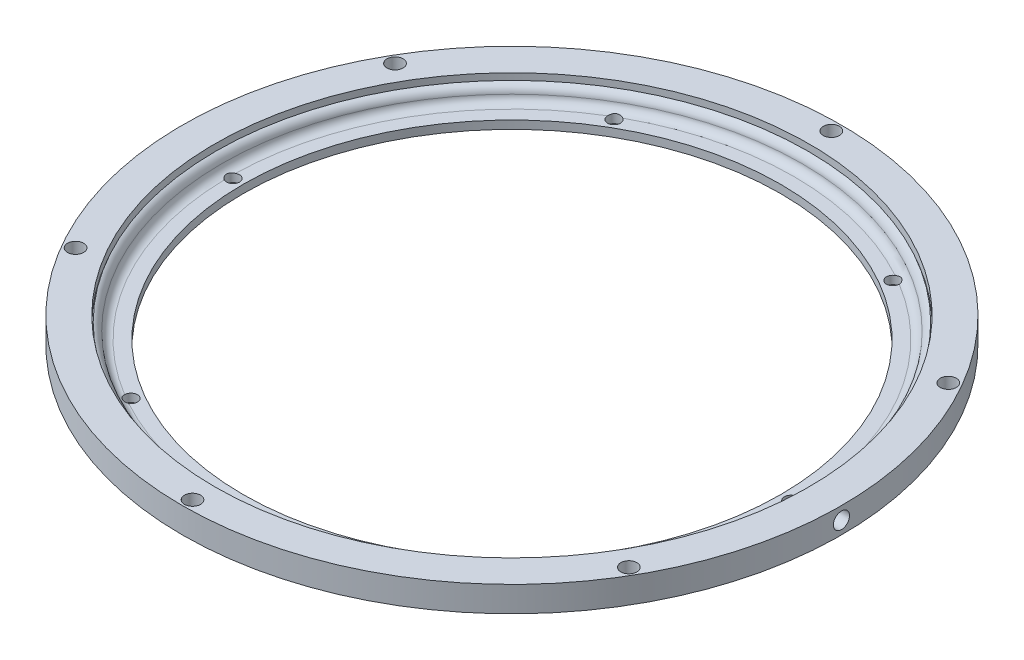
from build123d import *

# Parameters (mm, degrees)
CUT_EXTRUDE1_REACH            = 232.253
CUT_EXTRUDE1_END_MAJOR_RADIUS = 139.0875
CUT_EXTRUDE1_END_MINOR_RADIUS = 7.769966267
CIRPATTERN1_COUNT             = 6
CUT_EXTRUDE2_DEPTH            = 10
CIRPATTERN2_COUNT             = 6
SKETCH5_R                     = 3.175
CUT_EXTRUDE3_DEPTH            = 231.039850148
CIRPATTERN3_COUNT             = 6
SKETCH8_W                     = 9
SKETCH8_H                     = 10
REVOLVE3_ANGLE                = 5
SKETCH7_W                     = 14.5
SKETCH7_H                     = 3.96875
SKETCH9_R                     = 3.96875
CUT_EXTRUDE4_DEPTH            = 231.253409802
CIRPATTERN4_COUNT             = 6


with BuildPart() as part:
    # Sketch1 → Revolve2 (revolve)
    with BuildSketch(Plane.XY, mode=Mode.PRIVATE) as revolve2_sk:
        with BuildLine():
            Line((162.5, 14.2875), (162.5, 1.733499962))
            Line((162.5, 1.733499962), (149.5, 1.733499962))
            Line((149.5, 1.733499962), (149.5, 4.768474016))
            ThreePointArc((149.5, 4.768474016), (150.206637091, 8.669318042), (146.5, 10.075291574))
            Line((146.5, 10.075291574), (146.5, 14.2875))
            Line((146.5, 14.2875), (162.5, 14.2875))
        make_face()
        with BuildLine():
            Line((132.516, 0), (148, 0))
            Line((148, 0), (148, 4.083041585))
            ThreePointArc((148, 4.083041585), (144.579009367, 6.128361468), (146, 9.852243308))
            Line((146, 9.852243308), (146, 11.383553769))
            ThreePointArc((146, 11.383553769), (143.960917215, 9.912902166), (143.028992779, 7.57790932))
            ThreePointArc((143.028992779, 7.57790932), (141.749116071, 5.027879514), (139.0875, 4))
            Line((139.0875, 4), (132.516, 4))
            Line((132.516, 4), (132.516, 0))
        make_face()
    revolve(revolve2_sk.sketch.rotate(Axis((0, 8.550989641, 0), (0, -1, 0)), 90), axis=Axis((0, 8.550989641, 0), (0, -1, 0)))

    # Cut-Extrude1: up to this torus (the profile starts outside it)
    cut_extrude1_end = Plane(origin=(0, 7.959966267, 0), z_dir=(0, 1, 0)) * Torus(CUT_EXTRUDE1_END_MAJOR_RADIUS, CUT_EXTRUDE1_END_MINOR_RADIUS, mode=Mode.PRIVATE)
    # Sketch2 → Cut-Extrude1 (cut, up to the surface)
    with BuildSketch(Plane.XZ, mode=Mode.PRIVATE) as cut_extrude1_sk1:
        with BuildLine():
            ThreePointArc((75.01090718, -111.6598319), (116.494273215, -67.258), (134.205704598, -9.131435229))
            ThreePointArc((134.205704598, -9.131435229), (137.385386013, -6.356883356), (140.159937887, -9.536564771))
            ThreePointArc((140.159937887, -9.536564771), (121.662712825, -70.242), (78.3388763, -116.613784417))
            ThreePointArc((78.3388763, -116.613784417), (74.197915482, -115.800792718), (75.01090718, -111.6598319))
        make_face()
    cut_extrude1_tool1 = extrude(cut_extrude1_sk1.sketch, amount=-CUT_EXTRUDE1_REACH, mode=Mode.PRIVATE) - cut_extrude1_end
    cut_extrude1 = cut_extrude1_tool1.solids().sort_by_distance((120.543923, 0, -69.596066))[0]
    add(cut_extrude1, mode=Mode.SUBTRACT)

    # CirPattern1: Cut-Extrude1 ×6 about axis
    cirpattern1_axis = Axis((0, 0, 0), (0, 1, 0))
    for i in range(1, CIRPATTERN1_COUNT):
        add(cut_extrude1.rotate(cirpattern1_axis, i * 360 / CIRPATTERN1_COUNT), mode=Mode.SUBTRACT)

    # Sketch3 → Cut-Extrude2 (cut)
    with BuildSketch(Plane.XZ.offset(-1.733499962)):
        with BuildLine():
            Line((142.795745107, 73.277726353), (134.991399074, 68.77188507))
            ThreePointArc((134.991399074, 68.77188507), (151.5, 0), (134.991399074, -68.77188507))
            Line((134.991399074, -68.77188507), (142.795745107, -73.277726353))
            ThreePointArc((142.795745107, -73.277726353), (160.5, 0), (142.795745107, 73.277726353))
        make_face()
    cut_extrude2 = extrude(amount=-CUT_EXTRUDE2_DEPTH, mode=Mode.SUBTRACT)

    # CirPattern2: Cut-Extrude2 ×6 about axis
    cirpattern2_axis = Axis((0, 0, 0), (0, 1, 0))
    for i in range(1, CIRPATTERN2_COUNT):
        add(cut_extrude2.rotate(cirpattern2_axis, i * 360 / CIRPATTERN2_COUNT), mode=Mode.SUBTRACT)

    # Sketch5 → Cut-Extrude3 (cut, symmetric)
    with BuildSketch(Plane(origin=(0, 4, 0), x_dir=(-1, 0, 0), z_dir=(0, 1, 0))):
        with Locations(Location((-68.75, -119.07849302, 0), (0, 0, 90))):
            Circle(SKETCH5_R)
    cut_extrude3 = extrude(amount=CUT_EXTRUDE3_DEPTH, both=True, mode=Mode.SUBTRACT)

    # CirPattern3: Cut-Extrude3 ×6 about axis
    cirpattern3_axis = Axis((0, 0, 0), (0, 1, 0))
    for i in range(1, CIRPATTERN3_COUNT):
        add(cut_extrude3.rotate(cirpattern3_axis, i * 360 / CIRPATTERN3_COUNT), mode=Mode.SUBTRACT)

    # Sketch8 → Revolve3 (revolve, symmetric)
    with BuildSketch(Plane.XY) as revolve3_sk:
        with Locations((156, 6.733499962)):
            Rectangle(SKETCH8_W, SKETCH8_H)
    revolve(axis=Axis((0, 29.518266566, 0), (0, -1, 0)), revolution_arc=REVOLVE3_ANGLE / 2)
    revolve(revolve3_sk.sketch, axis=Axis((0, 29.518266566, 0), (0, 1, 0)), revolution_arc=REVOLVE3_ANGLE / 2)

    # Sketch7 → Cut-Revolve3 (revolve, cut)
    with BuildSketch(Plane.XY, mode=Mode.PRIVATE) as cut_revolve3_sk:
        with Locations((155.25, 9.994874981)):
            Rectangle(SKETCH7_W, SKETCH7_H)
    revolve(cut_revolve3_sk.sketch.rotate(Axis((162.5, 8.010499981, 0), (1, 0, 0)), 56.547173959), axis=Axis((162.5, 8.010499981, 0), (1, 0, 0)), mode=Mode.SUBTRACT)

    # Sketch9 → Cut-Extrude4 (cut, through all)
    with BuildSketch(Plane(origin=(0, 14.2875, 0), x_dir=(-1, 0, 0), z_dir=(0, 1, 0))):
        with Locations(Location((-136.399001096, -78.75, 0), (0, 0, 90))):
            Circle(SKETCH9_R)
    cut_extrude4 = extrude(amount=-CUT_EXTRUDE4_DEPTH, mode=Mode.SUBTRACT)

    # CirPattern4: Cut-Extrude4 ×6 about axis
    cirpattern4_axis = Axis((0, 0, 0), (0, 1, 0))
    for i in range(1, CIRPATTERN4_COUNT):
        add(cut_extrude4.rotate(cirpattern4_axis, i * 360 / CIRPATTERN4_COUNT), mode=Mode.SUBTRACT)


solid = part.part
